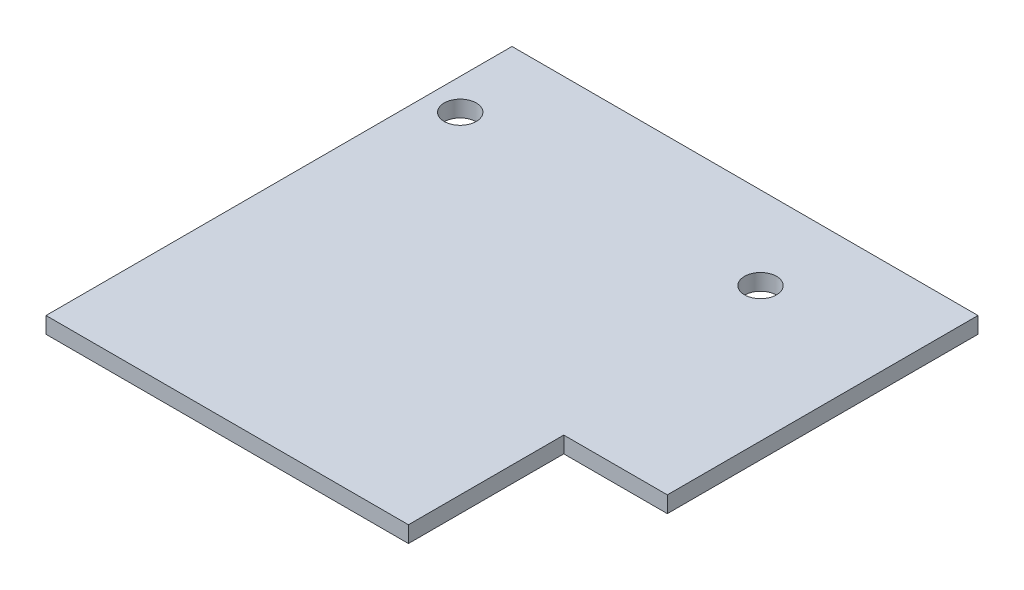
from build123d import *

# Parameters (mm, degrees)
SKETCH2_W                  = 45
SKETCH2_H                  = 1.5748
BOSS_EXTRUDE2_DEPTH        = 17.5
F_3_1_3_1_DIAMETER_HOLE1_D = 3.1
SKETCH5_W                  = 30
SKETCH5_H                  = 1.5748
BOSS_EXTRUDE3_DEPTH        = 10


with BuildPart() as part:
    # Sketch2 → Boss-Extrude2 (new, symmetric)
    with BuildSketch(Plane(origin=(0, 0, 0), x_dir=(0, 0, -1), z_dir=(1, 0, 0))):
        with Locations((22.5, 0.7874)):
            Rectangle(SKETCH2_W, SKETCH2_H)
    extrude(amount=BOSS_EXTRUDE2_DEPTH, both=True)

    # 3.1 _3.1_ Diameter Hole1 (through all)
    with Locations(Plane(origin=(0, 1.5748, 0), x_dir=(1, 0, 0), z_dir=(0, 1, 0))):
        with Locations((-14.5, 37), (14.5, 37)):
            Hole(F_3_1_3_1_DIAMETER_HOLE1_D / 2)

    # Sketch5 → Boss-Extrude3 (add)
    with BuildSketch(Plane(origin=(17.5, 0, 0), x_dir=(0, 0, -1), z_dir=(1, 0, 0))):
        with Locations((30, 0.7874)):
            Rectangle(SKETCH5_W, SKETCH5_H)
    extrude(amount=BOSS_EXTRUDE3_DEPTH)


solid = part.part
